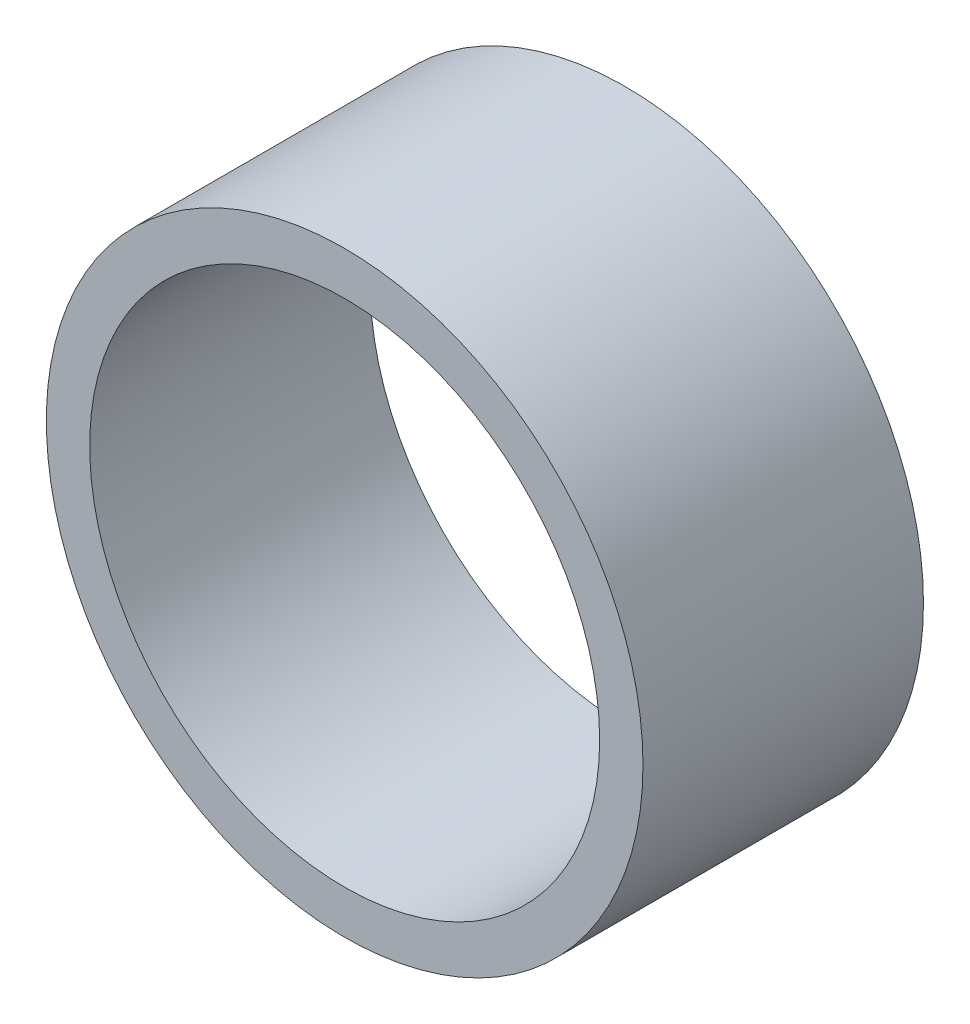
from build123d import *

# Parameters (mm, degrees)
ESQUISSE1_R      = 23.4
ESQUISSE1_R_2    = 20
EXTRUSION1_DEPTH = 22


with BuildPart() as part:
    # Esquisse1 → Extrusion1 (new body)
    with BuildSketch(Plane.XY):
        Circle(ESQUISSE1_R)
        Circle(ESQUISSE1_R_2, mode=Mode.SUBTRACT)
    extrude(amount=EXTRUSION1_DEPTH)


solid = part.part
